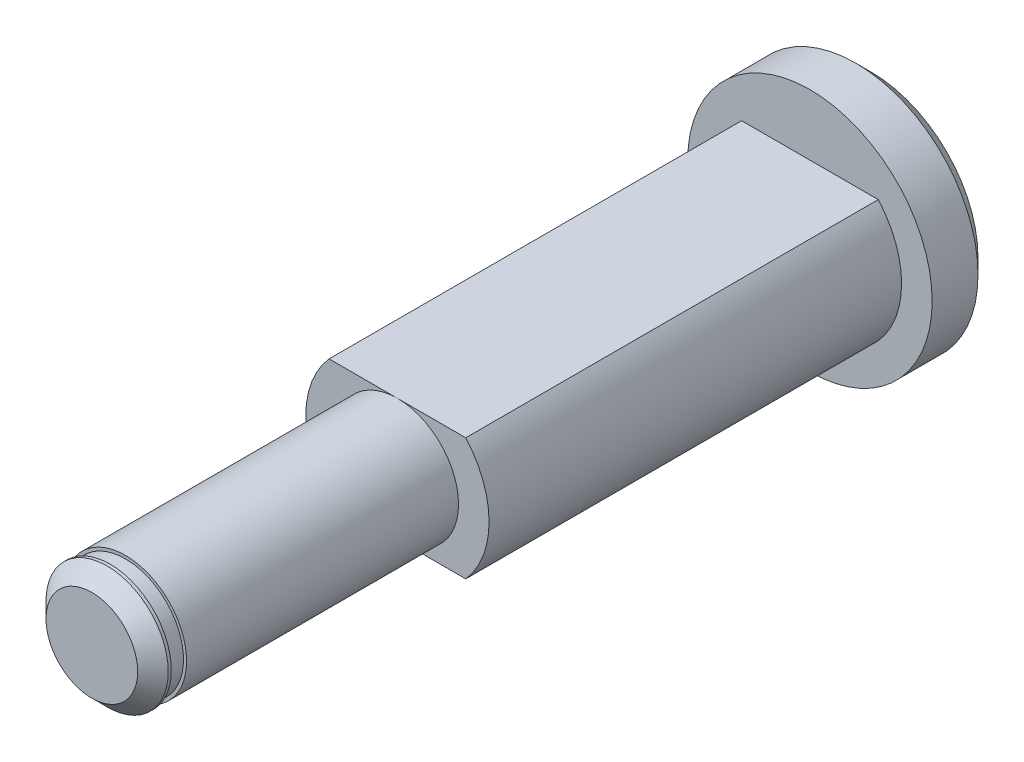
from build123d import *

# Parameters (mm, degrees)
ESQUISSE1_R             = 2
EXTRUSION1_DEPTH        = 10
CHANFREIN1_SIZE         = 0.5
ESQUISSE2_W             = 0.5
ESQUISSE2_H             = 0.407181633
ESQUISSE3_R             = 3
EXTRUSION2_DEPTH        = 13.5
ESQUISSE4_OUTSIDE_W     = 12.996
ESQUISSE4_OUTSIDE_H     = 12.996
ESQUISSE4_OUTSIDE_W_2   = 8.460133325
ESQUISSE4_OUTSIDE_H_2   = 4
ENL_V_MAT_EXTRU_2_DEPTH = 15.150971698
ESQUISSE5_R             = 4
EXTRUSION3_DEPTH        = 2
CHANFREIN2_SIZE         = 0.5


with BuildPart() as part:
    # Esquisse1 → Extrusion1 (new body)
    with BuildSketch(Plane.XY):
        Circle(ESQUISSE1_R)
    extrude(amount=EXTRUSION1_DEPTH)

    # Chanfrein1
    chanfrein1_edges = [part.edges().sort_by_distance(p)[0] for p in [
        (-2, 0, 10),
    ]]
    chamfer(chanfrein1_edges, length=CHANFREIN1_SIZE)

    # Esquisse2 → Enl_vement de mati_re-R_volution1 (revolve, cut)
    with BuildSketch(Plane(origin=(0, 0, 0), x_dir=(0, 0, -1), z_dir=(1, 0, 0)), mode=Mode.PRIVATE) as enl_vement_de_mati_re_r_volution1_sk:
        with Locations((-9.15, 2.103590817)):
            Rectangle(ESQUISSE2_W, ESQUISSE2_H)
    revolve(enl_vement_de_mati_re_r_volution1_sk.sketch.rotate(Axis((0, 0, 0), (0, 0, 1)), 90), axis=Axis((0, 0, 0), (0, 0, 1)), mode=Mode.SUBTRACT)

    # Esquisse3 → Extrusion2 (add)
    with BuildSketch(Plane.XY):
        Circle(ESQUISSE3_R)
    extrude(amount=-EXTRUSION2_DEPTH)

    # Esquisse4 outside → Enl_v. mat.-Extru.2 (cut, through all)
    with BuildSketch(Plane.XY):
        Rectangle(ESQUISSE4_OUTSIDE_W, ESQUISSE4_OUTSIDE_H)
        with Locations((0.443330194, 0)):
            Rectangle(ESQUISSE4_OUTSIDE_W_2, ESQUISSE4_OUTSIDE_H_2, mode=Mode.SUBTRACT)
    extrude(amount=-ENL_V_MAT_EXTRU_2_DEPTH, mode=Mode.SUBTRACT)

    # Esquisse5 → Extrusion3 (add)
    with BuildSketch(Plane(origin=(0, 0, -13.5), x_dir=(-1, 0, 0), z_dir=(0, 0, -1))):
        Circle(ESQUISSE5_R)
    extrude(amount=EXTRUSION3_DEPTH)

    # Chanfrein2
    chanfrein2_edges = [part.edges().sort_by_distance(p)[0] for p in [
        (4, 0, -15.5),
    ]]
    chamfer(chanfrein2_edges, length=CHANFREIN2_SIZE)


solid = part.part
